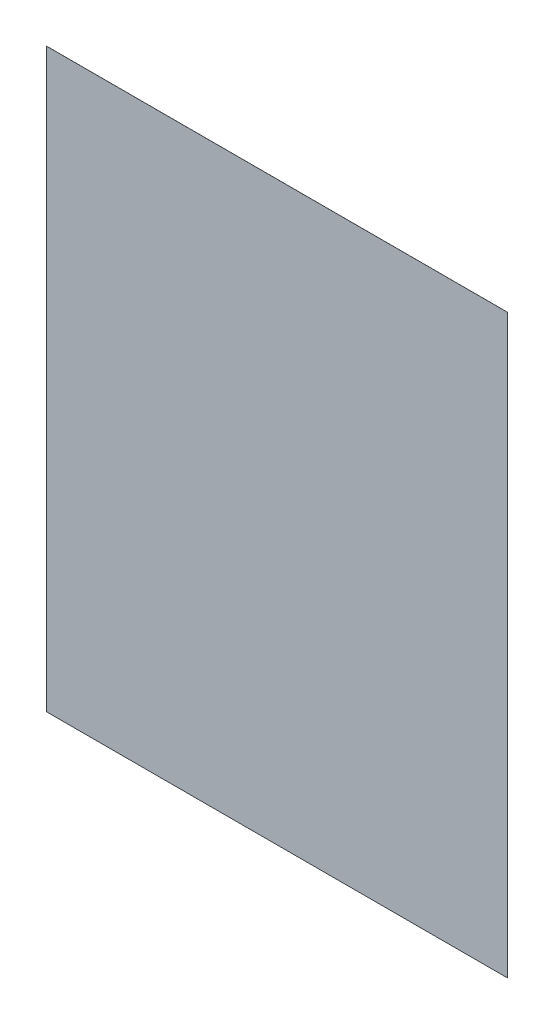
ISO-10303-21;
HEADER;
FILE_DESCRIPTION(('STEP AP214'),'2;1');
FILE_NAME('part.step','',(''),(''),'','','');
FILE_SCHEMA(('AUTOMOTIVE_DESIGN { 1 0 10303 214 1 1 1 1 }'));
ENDSEC;
DATA;
#1=APPLICATION_CONTEXT('core data for automotive mechanical design processes');
#2=APPLICATION_PROTOCOL_DEFINITION('international standard','automotive_design',2000,#1);
#3=PRODUCT_CONTEXT('',#1,'mechanical');
#4=PRODUCT('Part','Part','',(#3));
#5=PRODUCT_RELATED_PRODUCT_CATEGORY('part','',(#4));
#6=PRODUCT_DEFINITION_FORMATION('','',#4);
#7=PRODUCT_DEFINITION_CONTEXT('part definition',#1,'design');
#8=PRODUCT_DEFINITION('design','',#6,#7);
#9=PRODUCT_DEFINITION_SHAPE('','',#8);
#10=(LENGTH_UNIT() NAMED_UNIT(*) SI_UNIT(.MILLI.,.METRE.));
#11=(NAMED_UNIT(*) PLANE_ANGLE_UNIT() SI_UNIT($,.RADIAN.));
#12=(NAMED_UNIT(*) SI_UNIT($,.STERADIAN.) SOLID_ANGLE_UNIT());
#13=UNCERTAINTY_MEASURE_WITH_UNIT(LENGTH_MEASURE(1.E-05),#10,'distance_accuracy_value','');
#14=(GEOMETRIC_REPRESENTATION_CONTEXT(3) GLOBAL_UNCERTAINTY_ASSIGNED_CONTEXT((#13)) GLOBAL_UNIT_ASSIGNED_CONTEXT((#10,
#11,#12)) REPRESENTATION_CONTEXT('',''));
#15=CARTESIAN_POINT('',(0.,0.,0.));
#16=DIRECTION('',(0.,0.,1.));
#17=DIRECTION('',(1.,0.,0.));
#18=AXIS2_PLACEMENT_3D('',#15,#16,#17);
#19=CARTESIAN_POINT('',(-50.8,63.5,0.01));
#20=DIRECTION('',(1.,0.,0.));
#21=DIRECTION('',(0.,0.,-1.));
#22=AXIS2_PLACEMENT_3D('',#19,#20,#21);
#23=PLANE('',#22);
#24=DIRECTION('',(0.,-1.,0.));
#25=VECTOR('',#24,1.);
#26=CARTESIAN_POINT('',(-50.8,63.5,0.));
#27=LINE('',#26,#25);
#28=CARTESIAN_POINT('',(-50.8,63.5,0.));
#29=VERTEX_POINT('',#28);
#30=CARTESIAN_POINT('',(-50.8,-63.5,0.));
#31=VERTEX_POINT('',#30);
#32=EDGE_CURVE('E106',#29,#31,#27,.T.);
#33=ORIENTED_EDGE('',*,*,#32,.T.);
#34=DIRECTION('',(0.,0.,-1.));
#35=VECTOR('',#34,1.);
#36=CARTESIAN_POINT('',(-50.8,-63.5,0.01));
#37=LINE('',#36,#35);
#38=CARTESIAN_POINT('',(-50.8,-63.5,0.01));
#39=VERTEX_POINT('',#38);
#40=EDGE_CURVE('E11',#39,#31,#37,.T.);
#41=ORIENTED_EDGE('',*,*,#40,.F.);
#42=DIRECTION('',(0.,-1.,0.));
#43=VECTOR('',#42,1.);
#44=CARTESIAN_POINT('',(-50.8,63.5,0.01));
#45=LINE('',#44,#43);
#46=CARTESIAN_POINT('',(-50.8,63.5,0.01));
#47=VERTEX_POINT('',#46);
#48=EDGE_CURVE('E94',#47,#39,#45,.T.);
#49=ORIENTED_EDGE('',*,*,#48,.F.);
#50=DIRECTION('',(0.,0.,-1.));
#51=VECTOR('',#50,1.);
#52=CARTESIAN_POINT('',(-50.8,63.5,0.01));
#53=LINE('',#52,#51);
#54=EDGE_CURVE('E102',#47,#29,#53,.T.);
#55=ORIENTED_EDGE('',*,*,#54,.T.);
#56=EDGE_LOOP('',(#33,#41,#49,#55));
#57=FACE_BOUND('',#56,.T.);
#58=ADVANCED_FACE('F43',(#57),#23,.F.);
#59=CARTESIAN_POINT('',(-50.8,-63.5,0.01));
#60=DIRECTION('',(0.,1.,0.));
#61=DIRECTION('',(0.,0.,1.));
#62=AXIS2_PLACEMENT_3D('',#59,#60,#61);
#63=PLANE('',#62);
#64=DIRECTION('',(1.,0.,0.));
#65=VECTOR('',#64,1.);
#66=CARTESIAN_POINT('',(-50.8,-63.5,0.));
#67=LINE('',#66,#65);
#68=CARTESIAN_POINT('',(50.8,-63.5,0.));
#69=VERTEX_POINT('',#68);
#70=EDGE_CURVE('E98',#31,#69,#67,.T.);
#71=ORIENTED_EDGE('',*,*,#70,.T.);
#72=DIRECTION('',(0.,0.,-1.));
#73=VECTOR('',#72,1.);
#74=CARTESIAN_POINT('',(50.8,-63.5,0.01));
#75=LINE('',#74,#73);
#76=CARTESIAN_POINT('',(50.8,-63.5,0.01));
#77=VERTEX_POINT('',#76);
#78=EDGE_CURVE('E51',#77,#69,#75,.T.);
#79=ORIENTED_EDGE('',*,*,#78,.F.);
#80=DIRECTION('',(1.,0.,0.));
#81=VECTOR('',#80,1.);
#82=CARTESIAN_POINT('',(-50.8,-63.5,0.01));
#83=LINE('',#82,#81);
#84=EDGE_CURVE('E89',#39,#77,#83,.T.);
#85=ORIENTED_EDGE('',*,*,#84,.F.);
#86=ORIENTED_EDGE('',*,*,#40,.T.);
#87=EDGE_LOOP('',(#71,#79,#85,#86));
#88=FACE_BOUND('',#87,.T.);
#89=ADVANCED_FACE('F97',(#88),#63,.F.);
#90=CARTESIAN_POINT('',(50.8,-63.5,0.01));
#91=DIRECTION('',(-1.,0.,0.));
#92=DIRECTION('',(0.,0.,1.));
#93=AXIS2_PLACEMENT_3D('',#90,#91,#92);
#94=PLANE('',#93);
#95=DIRECTION('',(0.,1.,0.));
#96=VECTOR('',#95,1.);
#97=CARTESIAN_POINT('',(50.8,-63.5,0.));
#98=LINE('',#97,#96);
#99=CARTESIAN_POINT('',(50.8,63.5,0.));
#100=VERTEX_POINT('',#99);
#101=EDGE_CURVE('E76',#69,#100,#98,.T.);
#102=ORIENTED_EDGE('',*,*,#101,.T.);
#103=DIRECTION('',(0.,0.,-1.));
#104=VECTOR('',#103,1.);
#105=CARTESIAN_POINT('',(50.8,63.5,0.01));
#106=LINE('',#105,#104);
#107=CARTESIAN_POINT('',(50.8,63.5,0.01));
#108=VERTEX_POINT('',#107);
#109=EDGE_CURVE('E99',#108,#100,#106,.T.);
#110=ORIENTED_EDGE('',*,*,#109,.F.);
#111=DIRECTION('',(0.,1.,0.));
#112=VECTOR('',#111,1.);
#113=CARTESIAN_POINT('',(50.8,-63.5,0.01));
#114=LINE('',#113,#112);
#115=EDGE_CURVE('E92',#77,#108,#114,.T.);
#116=ORIENTED_EDGE('',*,*,#115,.F.);
#117=ORIENTED_EDGE('',*,*,#78,.T.);
#118=EDGE_LOOP('',(#102,#110,#116,#117));
#119=FACE_BOUND('',#118,.T.);
#120=ADVANCED_FACE('F100',(#119),#94,.F.);
#121=CARTESIAN_POINT('',(50.8,63.5,0.01));
#122=DIRECTION('',(0.,-1.,0.));
#123=DIRECTION('',(0.,0.,-1.));
#124=AXIS2_PLACEMENT_3D('',#121,#122,#123);
#125=PLANE('',#124);
#126=DIRECTION('',(-1.,0.,0.));
#127=VECTOR('',#126,1.);
#128=CARTESIAN_POINT('',(50.8,63.5,0.));
#129=LINE('',#128,#127);
#130=EDGE_CURVE('E82',#100,#29,#129,.T.);
#131=ORIENTED_EDGE('',*,*,#130,.T.);
#132=ORIENTED_EDGE('',*,*,#54,.F.);
#133=DIRECTION('',(-1.,0.,0.));
#134=VECTOR('',#133,1.);
#135=CARTESIAN_POINT('',(50.8,63.5,0.01));
#136=LINE('',#135,#134);
#137=EDGE_CURVE('E59',#108,#47,#136,.T.);
#138=ORIENTED_EDGE('',*,*,#137,.F.);
#139=ORIENTED_EDGE('',*,*,#109,.T.);
#140=EDGE_LOOP('',(#131,#132,#138,#139));
#141=FACE_BOUND('',#140,.T.);
#142=ADVANCED_FACE('F113',(#141),#125,.F.);
#143=CARTESIAN_POINT('',(0.,0.,0.01));
#144=DIRECTION('',(0.,0.,1.));
#145=DIRECTION('',(1.,0.,0.));
#146=AXIS2_PLACEMENT_3D('',#143,#144,#145);
#147=PLANE('',#146);
#148=ORIENTED_EDGE('',*,*,#48,.T.);
#149=ORIENTED_EDGE('',*,*,#84,.T.);
#150=ORIENTED_EDGE('',*,*,#115,.T.);
#151=ORIENTED_EDGE('',*,*,#137,.T.);
#152=EDGE_LOOP('',(#148,#149,#150,#151));
#153=FACE_BOUND('',#152,.T.);
#154=ADVANCED_FACE('F90',(#153),#147,.T.);
#155=CARTESIAN_POINT('',(0.,0.,0.));
#156=DIRECTION('',(0.,0.,1.));
#157=DIRECTION('',(1.,0.,0.));
#158=AXIS2_PLACEMENT_3D('',#155,#156,#157);
#159=PLANE('',#158);
#160=ORIENTED_EDGE('',*,*,#32,.F.);
#161=ORIENTED_EDGE('',*,*,#130,.F.);
#162=ORIENTED_EDGE('',*,*,#101,.F.);
#163=ORIENTED_EDGE('',*,*,#70,.F.);
#164=EDGE_LOOP('',(#160,#161,#162,#163));
#165=FACE_BOUND('',#164,.T.);
#166=ADVANCED_FACE('F116',(#165),#159,.F.);
#167=CLOSED_SHELL('',(#58,#89,#120,#142,#154,#166));
#168=MANIFOLD_SOLID_BREP('B2',#167);
#169=ADVANCED_BREP_SHAPE_REPRESENTATION('',(#18,#168),#14);
#170=SHAPE_DEFINITION_REPRESENTATION(#9,#169);
ENDSEC;
END-ISO-10303-21;
